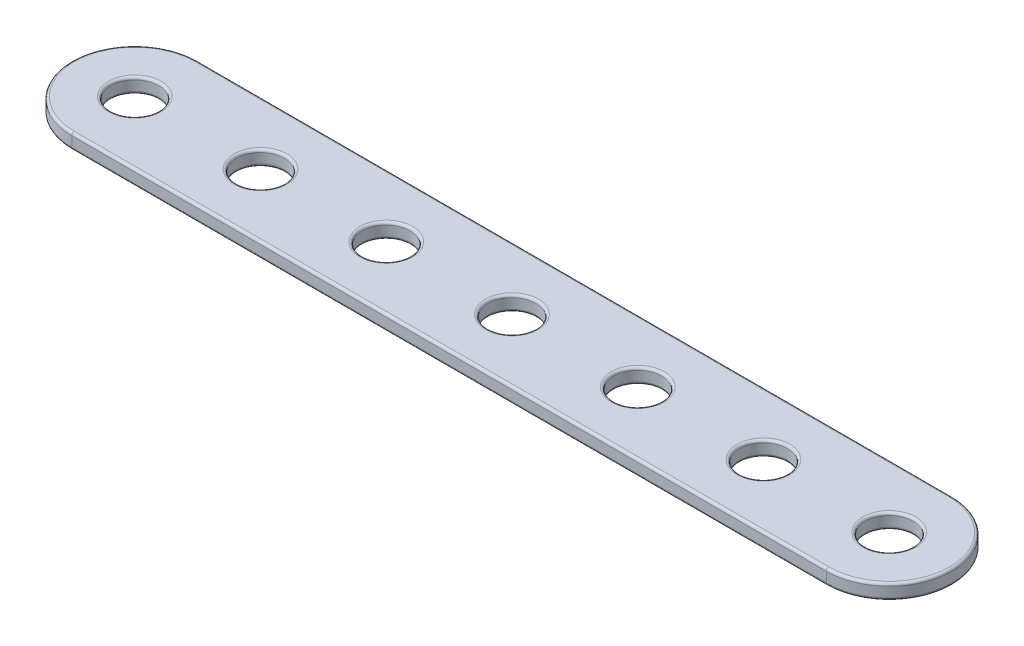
from build123d import *

# Parameters (mm, degrees)
EXTRUDE1_DEPTH     = 1.524
SKETCH2_R          = 2.413
CUT_EXTRUDE1_DEPTH = 84.535112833
LPATTERN1_COUNT    = 7
LPATTERN1_PITCH    = 12.7
FILLET1_R          = 0.254


with BuildPart() as part:
    # Sketch1 → Extrude1 (new body)
    with BuildSketch(Plane(origin=(0, 0, 0), x_dir=(1, 0, 0), z_dir=(0, 1, 0))):
        with BuildLine():
            Line((0, 0), (76.2, 0))
            ThreePointArc((76.2, 0), (82.55, 6.35), (76.2, 12.7))
            Line((76.2, 12.7), (0, 12.7))
            ThreePointArc((0, 12.7), (-6.35, 6.35), (0, 0))
        make_face()
    extrude(amount=EXTRUDE1_DEPTH)

    # Sketch2 → Cut-Extrude1 (cut, through all)
    with BuildSketch(Plane(origin=(0, 1.524, 0), x_dir=(-1, 0, 0), z_dir=(0, 1, 0))):
        with Locations(Location((0, -6.35, 0), (0, 0, 90))):
            Circle(SKETCH2_R)
    cut_extrude1 = extrude(amount=-CUT_EXTRUDE1_DEPTH, mode=Mode.SUBTRACT)

    # LPattern1: Cut-Extrude1 ×7
    with Locations(*[(i * LPATTERN1_PITCH, 0, 0) for i in range(1, LPATTERN1_COUNT)]):
        add(cut_extrude1, mode=Mode.SUBTRACT)

    # Fillet1
    fillet1_edges = [part.edges().sort_by_distance(p)[0] for p in [
        (82.55, 1.524, -6.35),
        (38.1, 1.524, -12.7),
        (0, 0, -8.763),
        (0, 1.524, -8.763),
        (12.7, 0, -8.763),
        (12.7, 1.524, -8.763),
        (25.4, 0, -8.763),
        (25.4, 1.524, -8.763),
        (38.1, 0, -8.763),
        (38.1, 1.524, -8.763),
        (50.8, 0, -8.763),
        (50.8, 1.524, -8.763),
        (63.5, 0, -8.763),
        (63.5, 1.524, -8.763),
        (76.2, 0, -8.763),
        (76.2, 1.524, -8.763),
        (-6.35, 1.524, -6.35),
        (38.1, 0, -12.7),
        (82.55, 0, -6.35),
        (38.1, 0, 0),
        (-6.35, 0, -6.35),
        (38.1, 1.524, 0),
    ]]
    fillet(fillet1_edges, radius=FILLET1_R)


solid = part.part
